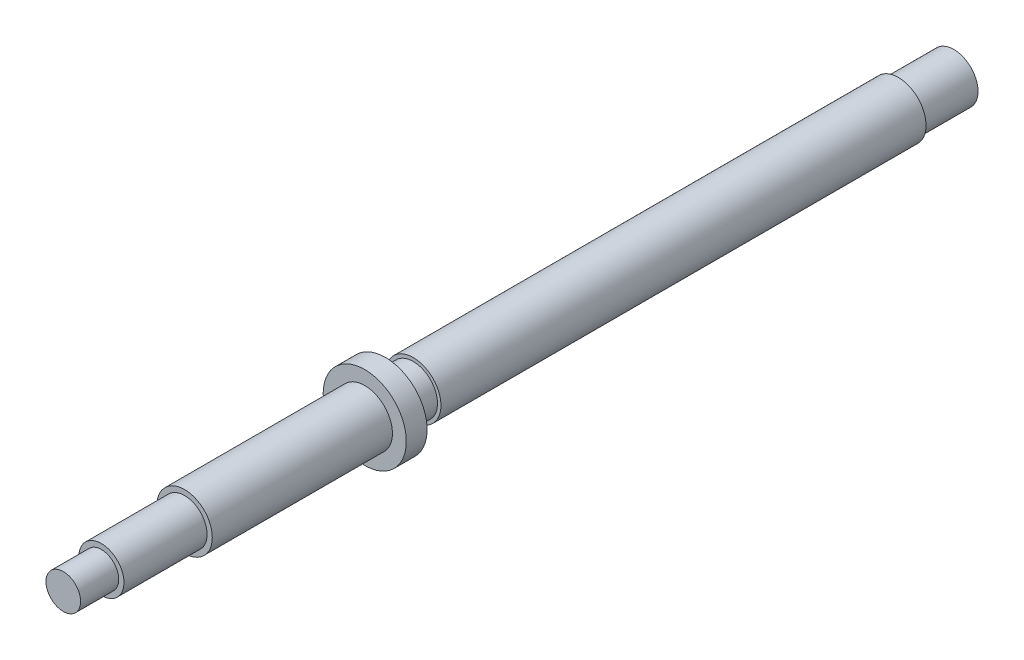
from build123d import *

# Parameters (mm, degrees)
SKETCH1_R           = 8
BOSS_EXTRUDE1_DEPTH = 128.5
SKETCH2_R           = 8
SKETCH2_R_2         = 6.5
CUT_EXTRUDE1_DEPTH  = 35
SKETCH3_R           = 6.5
SKETCH3_R_2         = 5
CUT_EXTRUDE2_DEPTH  = 11
CUT_EXTRUDE3_START  = -16
SKETCH4_R           = 8
SKETCH4_R_2         = 7
CUT_EXTRUDE3_DEPTH  = 16
CUT_EXTRUDE4_START  = -164
SKETCH5_R           = 8
SKETCH5_R_2         = 7
CUT_EXTRUDE4_DEPTH  = 8
BOSS_EXTRUDE2_START = -6
SKETCH6_R           = 12
SKETCH6_R_2         = 7
BOSS_EXTRUDE2_DEPTH = 6


with BuildPart() as part:
    # Sketch1 → Boss-Extrude1 (new, symmetric)
    with BuildSketch(Plane.XY):
        Circle(SKETCH1_R)
    extrude(amount=BOSS_EXTRUDE1_DEPTH, both=True)

    # Sketch2 → Cut-Extrude1 (cut)
    with BuildSketch(Plane.XY.offset(128.5)):
        Circle(SKETCH2_R)
        Circle(SKETCH2_R_2, mode=Mode.SUBTRACT)
    extrude(amount=-CUT_EXTRUDE1_DEPTH, mode=Mode.SUBTRACT)

    # Sketch3 → Cut-Extrude2 (cut)
    with BuildSketch(Plane.XY.offset(128.5)):
        Circle(SKETCH3_R)
        Circle(SKETCH3_R_2, mode=Mode.SUBTRACT)
    extrude(amount=-CUT_EXTRUDE2_DEPTH, mode=Mode.SUBTRACT)

    # Sketch4 → Cut-Extrude3 (cut)
    with BuildSketch(Plane(origin=(0, 0, -128.5), x_dir=(-1, 0, 0), z_dir=(0, 0, -1)).offset(CUT_EXTRUDE3_START)):
        Circle(SKETCH4_R)
        Circle(SKETCH4_R_2, mode=Mode.SUBTRACT)
    extrude(amount=CUT_EXTRUDE3_DEPTH, mode=Mode.SUBTRACT)

    # Sketch5 → Cut-Extrude4 (cut)
    with BuildSketch(Plane(origin=(0, 0, -128.5), x_dir=(-1, 0, 0), z_dir=(0, 0, -1)).offset(CUT_EXTRUDE4_START)):
        Circle(SKETCH5_R)
        Circle(SKETCH5_R_2, mode=Mode.SUBTRACT)
    extrude(amount=CUT_EXTRUDE4_DEPTH, mode=Mode.SUBTRACT)

    # Sketch6 → Boss-Extrude2 (add)
    with BuildSketch(Plane(origin=(0, 0, 35.5), x_dir=(-1, 0, 0), z_dir=(0, 0, -1)).offset(BOSS_EXTRUDE2_START)):
        Circle(SKETCH6_R)
        Circle(SKETCH6_R_2, mode=Mode.SUBTRACT)
    extrude(amount=BOSS_EXTRUDE2_DEPTH)


solid = part.part
